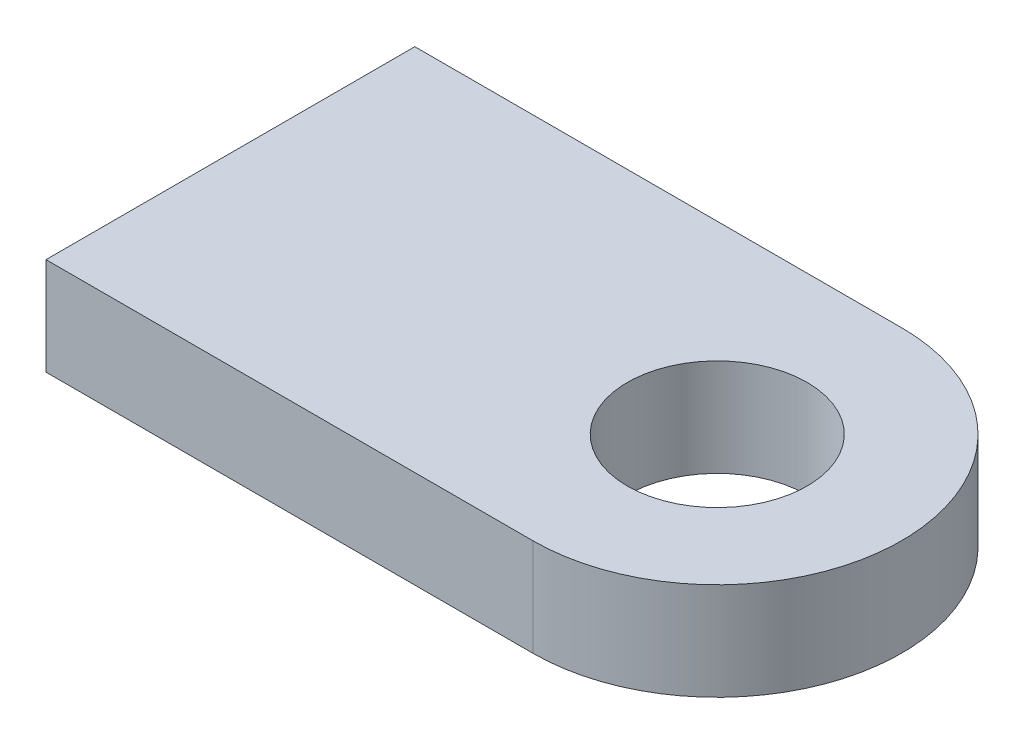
ISO-10303-21;
HEADER;
FILE_DESCRIPTION(('STEP AP214'),'2;1');
FILE_NAME('part.step','',(''),(''),'','','');
FILE_SCHEMA(('AUTOMOTIVE_DESIGN { 1 0 10303 214 1 1 1 1 }'));
ENDSEC;
DATA;
#1=APPLICATION_CONTEXT('core data for automotive mechanical design processes');
#2=APPLICATION_PROTOCOL_DEFINITION('international standard','automotive_design',2000,#1);
#3=PRODUCT_CONTEXT('',#1,'mechanical');
#4=PRODUCT('Part','Part','',(#3));
#5=PRODUCT_RELATED_PRODUCT_CATEGORY('part','',(#4));
#6=PRODUCT_DEFINITION_FORMATION('','',#4);
#7=PRODUCT_DEFINITION_CONTEXT('part definition',#1,'design');
#8=PRODUCT_DEFINITION('design','',#6,#7);
#9=PRODUCT_DEFINITION_SHAPE('','',#8);
#10=(LENGTH_UNIT() NAMED_UNIT(*) SI_UNIT(.MILLI.,.METRE.));
#11=(NAMED_UNIT(*) PLANE_ANGLE_UNIT() SI_UNIT($,.RADIAN.));
#12=(NAMED_UNIT(*) SI_UNIT($,.STERADIAN.) SOLID_ANGLE_UNIT());
#13=UNCERTAINTY_MEASURE_WITH_UNIT(LENGTH_MEASURE(1.E-05),#10,'distance_accuracy_value','');
#14=(GEOMETRIC_REPRESENTATION_CONTEXT(3) GLOBAL_UNCERTAINTY_ASSIGNED_CONTEXT((#13)) GLOBAL_UNIT_ASSIGNED_CONTEXT((#10,
#11,#12)) REPRESENTATION_CONTEXT('',''));
#15=CARTESIAN_POINT('',(0.,0.,0.));
#16=DIRECTION('',(0.,0.,1.));
#17=DIRECTION('',(1.,0.,0.));
#18=AXIS2_PLACEMENT_3D('',#15,#16,#17);
#19=CARTESIAN_POINT('',(0.,20.,0.));
#20=DIRECTION('',(0.,-1.,0.));
#21=DIRECTION('',(0.,0.,-1.));
#22=AXIS2_PLACEMENT_3D('',#19,#20,#21);
#23=PLANE('',#22);
#24=DIRECTION('',(1.,0.,0.));
#25=VECTOR('',#24,1.);
#26=CARTESIAN_POINT('',(0.,20.,37.8463218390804));
#27=LINE('',#26,#25);
#28=CARTESIAN_POINT('',(-99.9006513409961,20.,37.8463218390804));
#29=VERTEX_POINT('',#28);
#30=CARTESIAN_POINT('',(0.,20.,37.8463218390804));
#31=VERTEX_POINT('',#30);
#32=EDGE_CURVE('E95',#29,#31,#27,.T.);
#33=ORIENTED_EDGE('',*,*,#32,.T.);
#34=CARTESIAN_POINT('',(0.,20.,0.));
#35=DIRECTION('',(0.,1.,0.));
#36=DIRECTION('',(0.,0.,-1.));
#37=AXIS2_PLACEMENT_3D('',#34,#35,#36);
#38=CIRCLE('',#37,37.8463218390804);
#39=CARTESIAN_POINT('',(0.,20.,-37.8463218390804));
#40=VERTEX_POINT('',#39);
#41=EDGE_CURVE('E80',#31,#40,#38,.T.);
#42=ORIENTED_EDGE('',*,*,#41,.T.);
#43=DIRECTION('',(-1.,0.,0.));
#44=VECTOR('',#43,1.);
#45=CARTESIAN_POINT('',(-99.9006513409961,20.,-37.8463218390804));
#46=LINE('',#45,#44);
#47=CARTESIAN_POINT('',(-99.9006513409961,20.,-37.8463218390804));
#48=VERTEX_POINT('',#47);
#49=EDGE_CURVE('E46',#40,#48,#46,.T.);
#50=ORIENTED_EDGE('',*,*,#49,.T.);
#51=DIRECTION('',(0.,0.,1.));
#52=VECTOR('',#51,1.);
#53=CARTESIAN_POINT('',(-99.9006513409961,20.,37.8463218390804));
#54=LINE('',#53,#52);
#55=EDGE_CURVE('E41',#48,#29,#54,.T.);
#56=ORIENTED_EDGE('',*,*,#55,.T.);
#57=EDGE_LOOP('',(#33,#42,#50,#56));
#58=FACE_BOUND('',#57,.T.);
#59=CARTESIAN_POINT('',(0.,20.,0.));
#60=DIRECTION('',(0.,1.,0.));
#61=DIRECTION('',(0.,0.,1.));
#62=AXIS2_PLACEMENT_3D('',#59,#60,#61);
#63=CIRCLE('',#62,18.4411626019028);
#64=CARTESIAN_POINT('',(0.,20.,18.4411626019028));
#65=VERTEX_POINT('',#64);
#66=EDGE_CURVE('E85',#65,#65,#63,.T.);
#67=ORIENTED_EDGE('',*,*,#66,.F.);
#68=EDGE_LOOP('',(#67));
#69=FACE_BOUND('',#68,.T.);
#70=ADVANCED_FACE('F26',(#58,#69),#23,.F.);
#71=CARTESIAN_POINT('',(0.,0.,0.));
#72=DIRECTION('',(0.,-1.,0.));
#73=DIRECTION('',(0.,0.,-1.));
#74=AXIS2_PLACEMENT_3D('',#71,#72,#73);
#75=PLANE('',#74);
#76=DIRECTION('',(1.,0.,0.));
#77=VECTOR('',#76,1.);
#78=CARTESIAN_POINT('',(0.,0.,37.8463218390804));
#79=LINE('',#78,#77);
#80=CARTESIAN_POINT('',(-99.9006513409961,0.,37.8463218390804));
#81=VERTEX_POINT('',#80);
#82=CARTESIAN_POINT('',(0.,0.,37.8463218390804));
#83=VERTEX_POINT('',#82);
#84=EDGE_CURVE('E72',#81,#83,#79,.T.);
#85=ORIENTED_EDGE('',*,*,#84,.F.);
#86=DIRECTION('',(0.,0.,1.));
#87=VECTOR('',#86,1.);
#88=CARTESIAN_POINT('',(-99.9006513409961,0.,37.8463218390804));
#89=LINE('',#88,#87);
#90=CARTESIAN_POINT('',(-99.9006513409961,0.,-37.8463218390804));
#91=VERTEX_POINT('',#90);
#92=EDGE_CURVE('E93',#91,#81,#89,.T.);
#93=ORIENTED_EDGE('',*,*,#92,.F.);
#94=DIRECTION('',(-1.,0.,0.));
#95=VECTOR('',#94,1.);
#96=CARTESIAN_POINT('',(-99.9006513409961,0.,-37.8463218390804));
#97=LINE('',#96,#95);
#98=CARTESIAN_POINT('',(0.,0.,-37.8463218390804));
#99=VERTEX_POINT('',#98);
#100=EDGE_CURVE('E73',#99,#91,#97,.T.);
#101=ORIENTED_EDGE('',*,*,#100,.F.);
#102=CARTESIAN_POINT('',(0.,0.,0.));
#103=DIRECTION('',(0.,1.,0.));
#104=DIRECTION('',(0.,0.,-1.));
#105=AXIS2_PLACEMENT_3D('',#102,#103,#104);
#106=CIRCLE('',#105,37.8463218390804);
#107=EDGE_CURVE('E67',#83,#99,#106,.T.);
#108=ORIENTED_EDGE('',*,*,#107,.F.);
#109=EDGE_LOOP('',(#85,#93,#101,#108));
#110=FACE_BOUND('',#109,.T.);
#111=CARTESIAN_POINT('',(0.,0.,0.));
#112=DIRECTION('',(0.,1.,0.));
#113=DIRECTION('',(0.,0.,1.));
#114=AXIS2_PLACEMENT_3D('',#111,#112,#113);
#115=CIRCLE('',#114,18.4411626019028);
#116=CARTESIAN_POINT('',(0.,0.,18.4411626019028));
#117=VERTEX_POINT('',#116);
#118=EDGE_CURVE('E88',#117,#117,#115,.T.);
#119=ORIENTED_EDGE('',*,*,#118,.T.);
#120=EDGE_LOOP('',(#119));
#121=FACE_BOUND('',#120,.T.);
#122=ADVANCED_FACE('F68',(#110,#121),#75,.T.);
#123=CARTESIAN_POINT('',(0.,20.,37.8463218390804));
#124=DIRECTION('',(0.,0.,-1.));
#125=DIRECTION('',(-1.,0.,0.));
#126=AXIS2_PLACEMENT_3D('',#123,#124,#125);
#127=PLANE('',#126);
#128=ORIENTED_EDGE('',*,*,#84,.T.);
#129=DIRECTION('',(0.,-1.,0.));
#130=VECTOR('',#129,1.);
#131=CARTESIAN_POINT('',(0.,20.,37.8463218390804));
#132=LINE('',#131,#130);
#133=EDGE_CURVE('E11',#31,#83,#132,.T.);
#134=ORIENTED_EDGE('',*,*,#133,.F.);
#135=ORIENTED_EDGE('',*,*,#32,.F.);
#136=DIRECTION('',(0.,-1.,0.));
#137=VECTOR('',#136,1.);
#138=CARTESIAN_POINT('',(-99.9006513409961,20.,37.8463218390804));
#139=LINE('',#138,#137);
#140=EDGE_CURVE('E84',#29,#81,#139,.T.);
#141=ORIENTED_EDGE('',*,*,#140,.T.);
#142=EDGE_LOOP('',(#128,#134,#135,#141));
#143=FACE_BOUND('',#142,.T.);
#144=ADVANCED_FACE('F28',(#143),#127,.F.);
#145=CARTESIAN_POINT('',(0.,20.,0.));
#146=DIRECTION('',(0.,-1.,0.));
#147=DIRECTION('',(0.,0.,-1.));
#148=AXIS2_PLACEMENT_3D('',#145,#146,#147);
#149=CYLINDRICAL_SURFACE('',#148,37.8463218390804);
#150=ORIENTED_EDGE('',*,*,#107,.T.);
#151=DIRECTION('',(0.,-1.,0.));
#152=VECTOR('',#151,1.);
#153=CARTESIAN_POINT('',(0.,20.,-37.8463218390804));
#154=LINE('',#153,#152);
#155=EDGE_CURVE('E34',#40,#99,#154,.T.);
#156=ORIENTED_EDGE('',*,*,#155,.F.);
#157=ORIENTED_EDGE('',*,*,#41,.F.);
#158=ORIENTED_EDGE('',*,*,#133,.T.);
#159=EDGE_LOOP('',(#150,#156,#157,#158));
#160=FACE_BOUND('',#159,.T.);
#161=ADVANCED_FACE('F79',(#160),#149,.T.);
#162=CARTESIAN_POINT('',(-99.9006513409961,20.,-37.8463218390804));
#163=DIRECTION('',(0.,0.,1.));
#164=DIRECTION('',(1.,0.,0.));
#165=AXIS2_PLACEMENT_3D('',#162,#163,#164);
#166=PLANE('',#165);
#167=ORIENTED_EDGE('',*,*,#100,.T.);
#168=DIRECTION('',(0.,-1.,0.));
#169=VECTOR('',#168,1.);
#170=CARTESIAN_POINT('',(-99.9006513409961,20.,-37.8463218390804));
#171=LINE('',#170,#169);
#172=EDGE_CURVE('E101',#48,#91,#171,.T.);
#173=ORIENTED_EDGE('',*,*,#172,.F.);
#174=ORIENTED_EDGE('',*,*,#49,.F.);
#175=ORIENTED_EDGE('',*,*,#155,.T.);
#176=EDGE_LOOP('',(#167,#173,#174,#175));
#177=FACE_BOUND('',#176,.T.);
#178=ADVANCED_FACE('F104',(#177),#166,.F.);
#179=CARTESIAN_POINT('',(-99.9006513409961,20.,37.8463218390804));
#180=DIRECTION('',(1.,0.,0.));
#181=DIRECTION('',(0.,0.,-1.));
#182=AXIS2_PLACEMENT_3D('',#179,#180,#181);
#183=PLANE('',#182);
#184=ORIENTED_EDGE('',*,*,#92,.T.);
#185=ORIENTED_EDGE('',*,*,#140,.F.);
#186=ORIENTED_EDGE('',*,*,#55,.F.);
#187=ORIENTED_EDGE('',*,*,#172,.T.);
#188=EDGE_LOOP('',(#184,#185,#186,#187));
#189=FACE_BOUND('',#188,.T.);
#190=ADVANCED_FACE('F106',(#189),#183,.F.);
#191=CARTESIAN_POINT('',(0.,20.,0.));
#192=DIRECTION('',(0.,-1.,0.));
#193=DIRECTION('',(0.,0.,-1.));
#194=AXIS2_PLACEMENT_3D('',#191,#192,#193);
#195=CYLINDRICAL_SURFACE('',#194,18.4411626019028);
#196=ORIENTED_EDGE('',*,*,#66,.T.);
#197=EDGE_LOOP('',(#196));
#198=FACE_BOUND('',#197,.T.);
#199=ORIENTED_EDGE('',*,*,#118,.F.);
#200=EDGE_LOOP('',(#199));
#201=FACE_BOUND('',#200,.T.);
#202=ADVANCED_FACE('F112',(#198,#201),#195,.F.);
#203=CLOSED_SHELL('',(#70,#122,#144,#161,#178,#190,#202));
#204=MANIFOLD_SOLID_BREP('B2',#203);
#205=ADVANCED_BREP_SHAPE_REPRESENTATION('',(#18,#204),#14);
#206=SHAPE_DEFINITION_REPRESENTATION(#9,#205);
ENDSEC;
END-ISO-10303-21;
